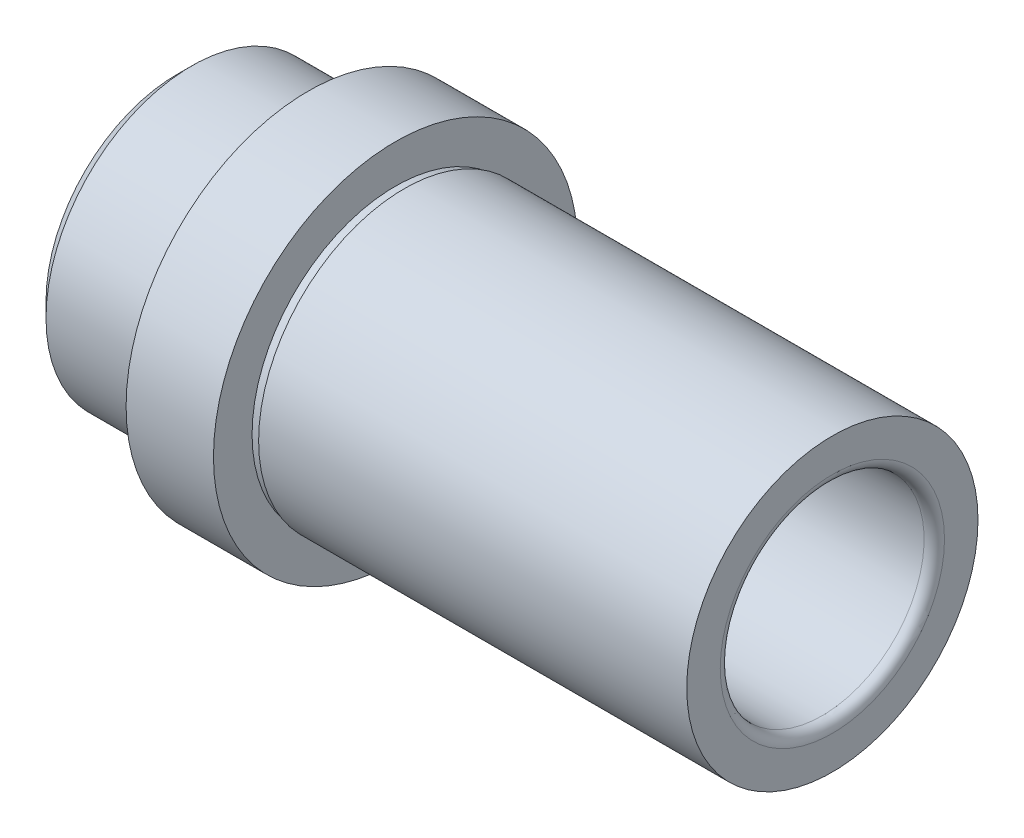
ISO-10303-21;
HEADER;
FILE_DESCRIPTION(('STEP AP214'),'2;1');
FILE_NAME('part.step','',(''),(''),'','','');
FILE_SCHEMA(('AUTOMOTIVE_DESIGN { 1 0 10303 214 1 1 1 1 }'));
ENDSEC;
DATA;
#1=APPLICATION_CONTEXT('core data for automotive mechanical design processes');
#2=APPLICATION_PROTOCOL_DEFINITION('international standard','automotive_design',2000,#1);
#3=PRODUCT_CONTEXT('',#1,'mechanical');
#4=PRODUCT('Part','Part','',(#3));
#5=PRODUCT_RELATED_PRODUCT_CATEGORY('part','',(#4));
#6=PRODUCT_DEFINITION_FORMATION('','',#4);
#7=PRODUCT_DEFINITION_CONTEXT('part definition',#1,'design');
#8=PRODUCT_DEFINITION('design','',#6,#7);
#9=PRODUCT_DEFINITION_SHAPE('','',#8);
#10=(LENGTH_UNIT() NAMED_UNIT(*) SI_UNIT(.MILLI.,.METRE.));
#11=(NAMED_UNIT(*) PLANE_ANGLE_UNIT() SI_UNIT($,.RADIAN.));
#12=(NAMED_UNIT(*) SI_UNIT($,.STERADIAN.) SOLID_ANGLE_UNIT());
#13=UNCERTAINTY_MEASURE_WITH_UNIT(LENGTH_MEASURE(1.E-05),#10,'distance_accuracy_value','');
#14=(GEOMETRIC_REPRESENTATION_CONTEXT(3) GLOBAL_UNCERTAINTY_ASSIGNED_CONTEXT((#13)) GLOBAL_UNIT_ASSIGNED_CONTEXT((#10,
#11,#12)) REPRESENTATION_CONTEXT('',''));
#15=CARTESIAN_POINT('',(0.,0.,0.));
#16=DIRECTION('',(0.,0.,1.));
#17=DIRECTION('',(1.,0.,0.));
#18=AXIS2_PLACEMENT_3D('',#15,#16,#17);
#19=CARTESIAN_POINT('',(-84.,139.,176.));
#20=DIRECTION('',(-1.,0.,0.));
#21=DIRECTION('',(0.,0.,1.));
#22=AXIS2_PLACEMENT_3D('',#19,#20,#21);
#23=CONICAL_SURFACE('',#22,8.,0.78539816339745);
#24=CARTESIAN_POINT('',(-83.,139.,176.));
#25=DIRECTION('',(-1.,0.,0.));
#26=DIRECTION('',(0.,0.,1.));
#27=AXIS2_PLACEMENT_3D('',#24,#25,#26);
#28=CIRCLE('',#27,7.);
#29=CARTESIAN_POINT('',(-83.,139.,183.));
#30=VERTEX_POINT('',#29);
#31=EDGE_CURVE('E10',#30,#30,#28,.T.);
#32=ORIENTED_EDGE('',*,*,#31,.F.);
#33=EDGE_LOOP('',(#32));
#34=FACE_BOUND('',#33,.T.);
#35=CARTESIAN_POINT('',(-84.,139.,176.));
#36=DIRECTION('',(-1.,0.,0.));
#37=DIRECTION('',(0.,0.,1.));
#38=AXIS2_PLACEMENT_3D('',#35,#36,#37);
#39=CIRCLE('',#38,8.);
#40=CARTESIAN_POINT('',(-84.,139.,184.));
#41=VERTEX_POINT('',#40);
#42=EDGE_CURVE('E63',#41,#41,#39,.T.);
#43=ORIENTED_EDGE('',*,*,#42,.T.);
#44=EDGE_LOOP('',(#43));
#45=FACE_BOUND('',#44,.T.);
#46=ADVANCED_FACE('F14',(#34,#45),#23,.F.);
#47=CARTESIAN_POINT('',(-39.,139.,176.));
#48=DIRECTION('',(-1.,0.,0.));
#49=DIRECTION('',(0.,0.,1.));
#50=AXIS2_PLACEMENT_3D('',#47,#48,#49);
#51=CYLINDRICAL_SURFACE('',#50,7.);
#52=CARTESIAN_POINT('',(-39.7,139.,176.));
#53=DIRECTION('',(-1.,0.,0.));
#54=DIRECTION('',(0.,0.,1.));
#55=AXIS2_PLACEMENT_3D('',#52,#53,#54);
#56=CIRCLE('',#55,7.);
#57=CARTESIAN_POINT('',(-39.7,139.,183.));
#58=VERTEX_POINT('',#57);
#59=EDGE_CURVE('E20',#58,#58,#56,.T.);
#60=ORIENTED_EDGE('',*,*,#59,.F.);
#61=EDGE_LOOP('',(#60));
#62=FACE_BOUND('',#61,.T.);
#63=ORIENTED_EDGE('',*,*,#31,.T.);
#64=EDGE_LOOP('',(#63));
#65=FACE_BOUND('',#64,.T.);
#66=ADVANCED_FACE('F99',(#62,#65),#51,.F.);
#67=CARTESIAN_POINT('',(-39.7,139.,176.));
#68=DIRECTION('',(-1.,0.,0.));
#69=DIRECTION('',(0.,0.,1.));
#70=AXIS2_PLACEMENT_3D('',#67,#68,#69);
#71=TOROIDAL_SURFACE('',#70,7.7,0.7);
#72=CARTESIAN_POINT('',(-39.,139.,176.));
#73=DIRECTION('',(-1.,0.,0.));
#74=DIRECTION('',(0.,0.,1.));
#75=AXIS2_PLACEMENT_3D('',#72,#73,#74);
#76=CIRCLE('',#75,7.7);
#77=CARTESIAN_POINT('',(-39.,139.,183.7));
#78=VERTEX_POINT('',#77);
#79=EDGE_CURVE('E24',#78,#78,#76,.T.);
#80=ORIENTED_EDGE('',*,*,#79,.F.);
#81=EDGE_LOOP('',(#80));
#82=FACE_BOUND('',#81,.T.);
#83=ORIENTED_EDGE('',*,*,#59,.T.);
#84=EDGE_LOOP('',(#83));
#85=FACE_BOUND('',#84,.T.);
#86=ADVANCED_FACE('F104',(#82,#85),#71,.T.);
#87=CARTESIAN_POINT('',(-39.,146.7,176.));
#88=DIRECTION('',(-1.,0.,0.));
#89=DIRECTION('',(0.,0.,1.));
#90=AXIS2_PLACEMENT_3D('',#87,#88,#89);
#91=PLANE('',#90);
#92=CARTESIAN_POINT('',(-39.,139.,176.));
#93=DIRECTION('',(-1.,0.,0.));
#94=DIRECTION('',(0.,0.,1.));
#95=AXIS2_PLACEMENT_3D('',#92,#93,#94);
#96=CIRCLE('',#95,10.);
#97=CARTESIAN_POINT('',(-39.,139.,186.));
#98=VERTEX_POINT('',#97);
#99=EDGE_CURVE('E28',#98,#98,#96,.T.);
#100=ORIENTED_EDGE('',*,*,#99,.F.);
#101=EDGE_LOOP('',(#100));
#102=FACE_BOUND('',#101,.T.);
#103=ORIENTED_EDGE('',*,*,#79,.T.);
#104=EDGE_LOOP('',(#103));
#105=FACE_BOUND('',#104,.T.);
#106=ADVANCED_FACE('F109',(#102,#105),#91,.F.);
#107=CARTESIAN_POINT('',(-39.,139.,176.));
#108=DIRECTION('',(-1.,0.,0.));
#109=DIRECTION('',(0.,0.,1.));
#110=AXIS2_PLACEMENT_3D('',#107,#108,#109);
#111=CYLINDRICAL_SURFACE('',#110,10.);
#112=ORIENTED_EDGE('',*,*,#99,.T.);
#113=EDGE_LOOP('',(#112));
#114=FACE_BOUND('',#113,.T.);
#115=CARTESIAN_POINT('',(-68.4,139.,176.));
#116=DIRECTION('',(-1.,0.,0.));
#117=DIRECTION('',(0.,0.,1.));
#118=AXIS2_PLACEMENT_3D('',#115,#116,#117);
#119=CIRCLE('',#118,10.);
#120=CARTESIAN_POINT('',(-68.4,139.,186.));
#121=VERTEX_POINT('',#120);
#122=EDGE_CURVE('E33',#121,#121,#119,.T.);
#123=ORIENTED_EDGE('',*,*,#122,.F.);
#124=EDGE_LOOP('',(#123));
#125=FACE_BOUND('',#124,.T.);
#126=ADVANCED_FACE('F115',(#114,#125),#111,.T.);
#127=CARTESIAN_POINT('',(-68.4,149.,176.));
#128=DIRECTION('',(1.,0.,0.));
#129=DIRECTION('',(0.,0.,-1.));
#130=AXIS2_PLACEMENT_3D('',#127,#128,#129);
#131=PLANE('',#130);
#132=CARTESIAN_POINT('',(-68.4,139.,176.));
#133=DIRECTION('',(-1.,0.,0.));
#134=DIRECTION('',(0.,0.,1.));
#135=AXIS2_PLACEMENT_3D('',#132,#133,#134);
#136=CIRCLE('',#135,9.85);
#137=CARTESIAN_POINT('',(-68.4,139.,185.85));
#138=VERTEX_POINT('',#137);
#139=EDGE_CURVE('E36',#138,#138,#136,.T.);
#140=ORIENTED_EDGE('',*,*,#139,.F.);
#141=EDGE_LOOP('',(#140));
#142=FACE_BOUND('',#141,.T.);
#143=ORIENTED_EDGE('',*,*,#122,.T.);
#144=EDGE_LOOP('',(#143));
#145=FACE_BOUND('',#144,.T.);
#146=ADVANCED_FACE('F119',(#142,#145),#131,.F.);
#147=CARTESIAN_POINT('',(-39.,139.,176.));
#148=DIRECTION('',(-1.,0.,0.));
#149=DIRECTION('',(0.,0.,1.));
#150=AXIS2_PLACEMENT_3D('',#147,#148,#149);
#151=CYLINDRICAL_SURFACE('',#150,9.85);
#152=ORIENTED_EDGE('',*,*,#139,.T.);
#153=EDGE_LOOP('',(#152));
#154=FACE_BOUND('',#153,.T.);
#155=CARTESIAN_POINT('',(-69.,139.,176.));
#156=DIRECTION('',(-1.,0.,0.));
#157=DIRECTION('',(0.,0.,1.));
#158=AXIS2_PLACEMENT_3D('',#155,#156,#157);
#159=CIRCLE('',#158,9.85);
#160=CARTESIAN_POINT('',(-69.,139.,185.85));
#161=VERTEX_POINT('',#160);
#162=EDGE_CURVE('E39',#161,#161,#159,.T.);
#163=ORIENTED_EDGE('',*,*,#162,.F.);
#164=EDGE_LOOP('',(#163));
#165=FACE_BOUND('',#164,.T.);
#166=ADVANCED_FACE('F123',(#154,#165),#151,.T.);
#167=CARTESIAN_POINT('',(-69.,148.85,176.));
#168=DIRECTION('',(-1.,0.,0.));
#169=DIRECTION('',(0.,0.,1.));
#170=AXIS2_PLACEMENT_3D('',#167,#168,#169);
#171=PLANE('',#170);
#172=CARTESIAN_POINT('',(-69.,139.,176.));
#173=DIRECTION('',(-1.,0.,0.));
#174=DIRECTION('',(0.,0.,1.));
#175=AXIS2_PLACEMENT_3D('',#172,#173,#174);
#176=CIRCLE('',#175,12.5);
#177=CARTESIAN_POINT('',(-69.,139.,188.5));
#178=VERTEX_POINT('',#177);
#179=EDGE_CURVE('E42',#178,#178,#176,.T.);
#180=ORIENTED_EDGE('',*,*,#179,.F.);
#181=EDGE_LOOP('',(#180));
#182=FACE_BOUND('',#181,.T.);
#183=ORIENTED_EDGE('',*,*,#162,.T.);
#184=EDGE_LOOP('',(#183));
#185=FACE_BOUND('',#184,.T.);
#186=ADVANCED_FACE('F127',(#182,#185),#171,.F.);
#187=CARTESIAN_POINT('',(-39.,139.,176.));
#188=DIRECTION('',(-1.,0.,0.));
#189=DIRECTION('',(0.,0.,1.));
#190=AXIS2_PLACEMENT_3D('',#187,#188,#189);
#191=CYLINDRICAL_SURFACE('',#190,12.5);
#192=CARTESIAN_POINT('',(-75.,139.,176.));
#193=DIRECTION('',(-1.,0.,0.));
#194=DIRECTION('',(0.,0.,1.));
#195=AXIS2_PLACEMENT_3D('',#192,#193,#194);
#196=CIRCLE('',#195,12.5);
#197=CARTESIAN_POINT('',(-75.,139.,188.5));
#198=VERTEX_POINT('',#197);
#199=EDGE_CURVE('E45',#198,#198,#196,.T.);
#200=ORIENTED_EDGE('',*,*,#199,.F.);
#201=EDGE_LOOP('',(#200));
#202=FACE_BOUND('',#201,.T.);
#203=ORIENTED_EDGE('',*,*,#179,.T.);
#204=EDGE_LOOP('',(#203));
#205=FACE_BOUND('',#204,.T.);
#206=ADVANCED_FACE('F131',(#202,#205),#191,.T.);
#207=CARTESIAN_POINT('',(-75.,151.5,176.));
#208=DIRECTION('',(1.,0.,0.));
#209=DIRECTION('',(0.,0.,-1.));
#210=AXIS2_PLACEMENT_3D('',#207,#208,#209);
#211=PLANE('',#210);
#212=CARTESIAN_POINT('',(-75.,139.,176.));
#213=DIRECTION('',(-1.,0.,0.));
#214=DIRECTION('',(0.,0.,1.));
#215=AXIS2_PLACEMENT_3D('',#212,#213,#214);
#216=CIRCLE('',#215,9.85);
#217=CARTESIAN_POINT('',(-75.,139.,185.85));
#218=VERTEX_POINT('',#217);
#219=EDGE_CURVE('E48',#218,#218,#216,.T.);
#220=ORIENTED_EDGE('',*,*,#219,.F.);
#221=EDGE_LOOP('',(#220));
#222=FACE_BOUND('',#221,.T.);
#223=ORIENTED_EDGE('',*,*,#199,.T.);
#224=EDGE_LOOP('',(#223));
#225=FACE_BOUND('',#224,.T.);
#226=ADVANCED_FACE('F95',(#222,#225),#211,.F.);
#227=CARTESIAN_POINT('',(-39.,139.,176.));
#228=DIRECTION('',(-1.,0.,0.));
#229=DIRECTION('',(0.,0.,1.));
#230=AXIS2_PLACEMENT_3D('',#227,#228,#229);
#231=CYLINDRICAL_SURFACE('',#230,9.85);
#232=CARTESIAN_POINT('',(-75.6,139.,176.));
#233=DIRECTION('',(-1.,0.,0.));
#234=DIRECTION('',(0.,0.,1.));
#235=AXIS2_PLACEMENT_3D('',#232,#233,#234);
#236=CIRCLE('',#235,9.85);
#237=CARTESIAN_POINT('',(-75.6,139.,185.85));
#238=VERTEX_POINT('',#237);
#239=EDGE_CURVE('E51',#238,#238,#236,.T.);
#240=ORIENTED_EDGE('',*,*,#239,.F.);
#241=EDGE_LOOP('',(#240));
#242=FACE_BOUND('',#241,.T.);
#243=ORIENTED_EDGE('',*,*,#219,.T.);
#244=EDGE_LOOP('',(#243));
#245=FACE_BOUND('',#244,.T.);
#246=ADVANCED_FACE('F88',(#242,#245),#231,.T.);
#247=CARTESIAN_POINT('',(-75.6,149.,176.));
#248=DIRECTION('',(1.,0.,0.));
#249=DIRECTION('',(0.,0.,-1.));
#250=AXIS2_PLACEMENT_3D('',#247,#248,#249);
#251=PLANE('',#250);
#252=ORIENTED_EDGE('',*,*,#239,.T.);
#253=EDGE_LOOP('',(#252));
#254=FACE_BOUND('',#253,.T.);
#255=CARTESIAN_POINT('',(-75.6,139.,176.));
#256=DIRECTION('',(-1.,0.,0.));
#257=DIRECTION('',(0.,0.,1.));
#258=AXIS2_PLACEMENT_3D('',#255,#256,#257);
#259=CIRCLE('',#258,10.);
#260=CARTESIAN_POINT('',(-75.6,139.,186.));
#261=VERTEX_POINT('',#260);
#262=EDGE_CURVE('E54',#261,#261,#259,.T.);
#263=ORIENTED_EDGE('',*,*,#262,.F.);
#264=EDGE_LOOP('',(#263));
#265=FACE_BOUND('',#264,.T.);
#266=ADVANCED_FACE('F83',(#254,#265),#251,.T.);
#267=CARTESIAN_POINT('',(-39.,139.,176.));
#268=DIRECTION('',(-1.,0.,0.));
#269=DIRECTION('',(0.,0.,1.));
#270=AXIS2_PLACEMENT_3D('',#267,#268,#269);
#271=CYLINDRICAL_SURFACE('',#270,10.);
#272=CARTESIAN_POINT('',(-83.,139.,176.));
#273=DIRECTION('',(-1.,0.,0.));
#274=DIRECTION('',(0.,0.,1.));
#275=AXIS2_PLACEMENT_3D('',#272,#273,#274);
#276=CIRCLE('',#275,10.);
#277=CARTESIAN_POINT('',(-83.,139.,186.));
#278=VERTEX_POINT('',#277);
#279=EDGE_CURVE('E57',#278,#278,#276,.T.);
#280=ORIENTED_EDGE('',*,*,#279,.F.);
#281=EDGE_LOOP('',(#280));
#282=FACE_BOUND('',#281,.T.);
#283=ORIENTED_EDGE('',*,*,#262,.T.);
#284=EDGE_LOOP('',(#283));
#285=FACE_BOUND('',#284,.T.);
#286=ADVANCED_FACE('F77',(#282,#285),#271,.T.);
#287=CARTESIAN_POINT('',(-83.,139.,176.));
#288=DIRECTION('',(1.,0.,0.));
#289=DIRECTION('',(0.,0.,-1.));
#290=AXIS2_PLACEMENT_3D('',#287,#288,#289);
#291=CONICAL_SURFACE('',#290,10.,0.785398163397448);
#292=CARTESIAN_POINT('',(-84.,139.,176.));
#293=DIRECTION('',(-1.,0.,0.));
#294=DIRECTION('',(0.,0.,1.));
#295=AXIS2_PLACEMENT_3D('',#292,#293,#294);
#296=CIRCLE('',#295,9.);
#297=CARTESIAN_POINT('',(-84.,139.,185.));
#298=VERTEX_POINT('',#297);
#299=EDGE_CURVE('E60',#298,#298,#296,.T.);
#300=ORIENTED_EDGE('',*,*,#299,.F.);
#301=EDGE_LOOP('',(#300));
#302=FACE_BOUND('',#301,.T.);
#303=ORIENTED_EDGE('',*,*,#279,.T.);
#304=EDGE_LOOP('',(#303));
#305=FACE_BOUND('',#304,.T.);
#306=ADVANCED_FACE('F71',(#302,#305),#291,.T.);
#307=CARTESIAN_POINT('',(-84.,148.,176.));
#308=DIRECTION('',(1.,0.,0.));
#309=DIRECTION('',(0.,0.,-1.));
#310=AXIS2_PLACEMENT_3D('',#307,#308,#309);
#311=PLANE('',#310);
#312=ORIENTED_EDGE('',*,*,#42,.F.);
#313=EDGE_LOOP('',(#312));
#314=FACE_BOUND('',#313,.T.);
#315=ORIENTED_EDGE('',*,*,#299,.T.);
#316=EDGE_LOOP('',(#315));
#317=FACE_BOUND('',#316,.T.);
#318=ADVANCED_FACE('F68',(#314,#317),#311,.F.);
#319=CLOSED_SHELL('',(#46,#66,#86,#106,#126,#146,#166,#186,#206,#226,#246,#266,#286,#306,#318));
#320=MANIFOLD_SOLID_BREP('B1',#319);
#321=ADVANCED_BREP_SHAPE_REPRESENTATION('',(#18,#320),#14);
#322=SHAPE_DEFINITION_REPRESENTATION(#9,#321);
ENDSEC;
END-ISO-10303-21;
